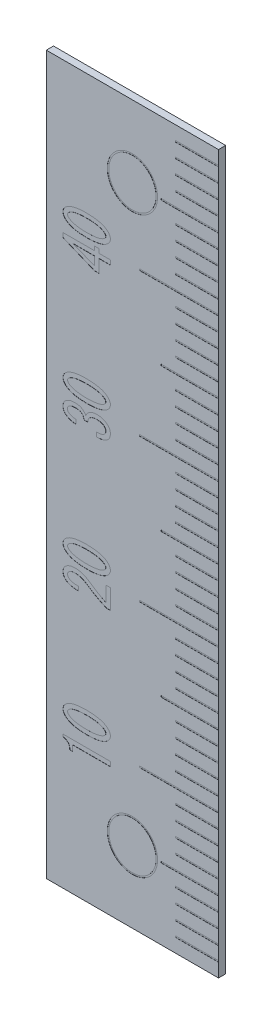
from build123d import *

# Parameters (mm, degrees)
SKETCH1_W      = 12
SKETCH1_H      = 50
EXTRUDE1_DEPTH = 0.5
SKETCH2_R      = 1.75
SKETCH2_R_2    = 1.65
EXTRUDE2_DEPTH = 0.01
EXTRUDE3_DEPTH = 0.01
SKETCH4_W      = 5.5
SKETCH4_H      = 0.1
SKETCH4_W_2    = 3
SKETCH4_W_3    = 4
EXTRUDE4_DEPTH = 0.01


with BuildPart() as part:
    # Sketch1 → Extrude1 (new body)
    with BuildSketch(Plane.XY):
        with Locations((6, 25)):
            Rectangle(SKETCH1_W, SKETCH1_H)
    extrude(amount=EXTRUDE1_DEPTH)

    # Sketch2 → Extrude2 (cut)
    # profile 1 of 2: a face of its own
    with BuildSketch(Plane.XY.offset(0.5)):
        with Locations((6, 5)):
            Circle(SKETCH2_R)
        with Locations((6, 5)):
            Circle(SKETCH2_R_2, mode=Mode.SUBTRACT)
    # profile 2 of 2: a face of its own
    with BuildSketch(Plane.XY.offset(0.5)):
        with Locations((6, 45)):
            Circle(SKETCH2_R)
        with Locations((6, 45)):
            Circle(SKETCH2_R_2, mode=Mode.SUBTRACT)
    extrude(amount=-EXTRUDE2_DEPTH, mode=Mode.SUBTRACT)

    # Sketch3 → Extrude3 (cut)
    # profile 1 of 8: a face of its own
    with BuildSketch(Plane.XY.offset(0.5)):
        Polygon((4.464202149, 39.253595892), (4.076078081, 39.253595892), (3.68481385, 39.253595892), (3.68481385, 38.358021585), (3.363889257, 38.358021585), (1.159495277, 39.263016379), (1.159495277, 39.57326442), (3.363889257, 39.57326442), (3.363889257, 39.857135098), (3.68481385, 39.857135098), (3.68481385, 39.57326442), (4.464202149, 39.57326442), align=None)
        Polygon((3.363889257, 39.253595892), (1.871684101, 39.253595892), (3.363889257, 38.655080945), align=None, mode=Mode.SUBTRACT)
    # profile 2 of 8: a face of its own
    with BuildSketch(Plane.XY.offset(0.5)):
        with BuildLine():
            add(Edge.make_bspline(
                [(2.804312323, 40.08636695), (2.763487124, 40.086598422), (2.683284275, 40.087053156), (2.565184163, 40.090916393), (2.451677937, 40.097059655), (2.342790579, 40.105920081), (2.238418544, 40.116877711), (2.138826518, 40.131643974), (2.043659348, 40.147711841), (1.953367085, 40.166540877), (1.867534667, 40.187646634), (1.786660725, 40.212475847), (1.709981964, 40.238496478), (1.63792646, 40.267351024), (1.571052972, 40.299483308), (1.508231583, 40.333293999), (1.450513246, 40.370357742), (1.414537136, 40.397244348), (1.396891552, 40.410431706)],
                knots=[0, 0, 0, 0, 1.334199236, 2.621091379, 3.861325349, 5.048806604, 6.191184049, 7.29033474, 8.338632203, 9.344988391, 10.304094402, 11.226124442, 12.10888774, 12.949942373, 13.760906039, 14.53244093, 15.280190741, 16, 16, 16, 16], degree=3))
            add(Edge.make_bspline(
                [(1.396891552, 40.410431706), (1.377886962, 40.425936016), (1.341081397, 40.455962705), (1.293642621, 40.506288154), (1.25209867, 40.556343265), (1.218531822, 40.608467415), (1.191781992, 40.661574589), (1.173561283, 40.716630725), (1.161657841, 40.77250316), (1.160214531, 40.810429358), (1.159495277, 40.829329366)],
                knots=[0, 0, 0, 0, 1.179273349, 2.283859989, 3.322502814, 4.306324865, 5.261663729, 6.17616916, 7.091118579, 8, 8, 8, 8], degree=3))
            add(Edge.make_bspline(
                [(1.159495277, 40.829329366), (1.160212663, 40.848230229), (1.161652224, 40.886158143), (1.17358392, 40.942017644), (1.191636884, 40.996945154), (1.218688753, 41.049705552), (1.252296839, 41.101723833), (1.293217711, 41.152330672), (1.341340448, 41.202029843), (1.377935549, 41.232049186), (1.396891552, 41.247598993)],
                knots=[0, 0, 0, 0, 0.909839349, 1.825753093, 2.741222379, 3.688535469, 4.673394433, 5.720979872, 6.819483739, 8, 8, 8, 8], degree=3))
            add(Edge.make_bspline(
                [(1.396891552, 41.247598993), (1.414537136, 41.260786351), (1.450513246, 41.287672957), (1.508231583, 41.3247367), (1.571052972, 41.358547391), (1.63792646, 41.390679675), (1.709981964, 41.419534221), (1.786660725, 41.445554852), (1.867534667, 41.470384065), (1.953367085, 41.491489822), (2.043659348, 41.510318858), (2.138826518, 41.526386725), (2.238418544, 41.541152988), (2.342790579, 41.552110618), (2.451677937, 41.560971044), (2.565184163, 41.567114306), (2.683284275, 41.570977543), (2.763487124, 41.571432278), (2.804312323, 41.571663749)],
                knots=[0, 0, 0, 0, 0.719809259, 1.46755907, 2.239093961, 3.050057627, 3.89111226, 4.773875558, 5.695905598, 6.655011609, 7.661367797, 8.70966526, 9.808815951, 10.951193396, 12.138674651, 13.378908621, 14.665800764, 16, 16, 16, 16], degree=3))
            add(Edge.make_bspline(
                [(2.804312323, 41.571663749), (2.845974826, 41.571432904), (2.927642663, 41.570980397), (3.047627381, 41.567132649), (3.162805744, 41.560946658), (3.273365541, 41.552091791), (3.379218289, 41.541255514), (3.480042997, 41.52631378), (3.576267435, 41.510328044), (3.667806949, 41.49146689), (3.75471717, 41.470480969), (3.836402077, 41.445542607), (3.913707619, 41.419531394), (3.986394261, 41.390685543), (4.053875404, 41.358519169), (4.117234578, 41.324907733), (4.175058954, 41.28765614), (4.211041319, 41.260780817), (4.228689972, 41.247598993)],
                knots=[0, 0, 0, 0, 1.346341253, 2.639130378, 3.8790076, 5.073442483, 6.223226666, 7.316783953, 8.366697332, 9.375051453, 10.336565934, 11.254764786, 12.134057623, 12.971986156, 13.779994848, 14.548849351, 15.288238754, 16, 16, 16, 16], degree=3))
            add(Edge.make_bspline(
                [(4.228689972, 41.247598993), (4.247351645, 41.231964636), (4.283604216, 41.201592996), (4.332476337, 41.152791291), (4.372490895, 41.101447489), (4.406527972, 41.049937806), (4.432289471, 40.996615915), (4.451811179, 40.942259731), (4.462410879, 40.886054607), (4.464024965, 40.848209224), (4.464830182, 40.829329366)],
                knots=[0, 0, 0, 0, 1.1743338, 2.28128622, 3.323893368, 4.309986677, 5.254013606, 6.173907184, 7.08902033, 8, 8, 8, 8], degree=3))
            add(Edge.make_bspline(
                [(4.464830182, 40.829329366), (4.464023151, 40.81045032), (4.462405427, 40.772606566), (4.45183315, 40.716389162), (4.432141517, 40.661902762), (4.406685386, 40.608236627), (4.372691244, 40.556620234), (4.332051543, 40.505827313), (4.283860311, 40.456400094), (4.247399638, 40.426020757), (4.228689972, 40.410431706)],
                knots=[0, 0, 0, 0, 0.910025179, 1.824179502, 2.743109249, 3.69522398, 4.680284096, 5.713901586, 6.826896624, 8, 8, 8, 8], degree=3))
            add(Edge.make_bspline(
                [(4.228689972, 40.410431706), (4.211041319, 40.397249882), (4.175058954, 40.370374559), (4.117234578, 40.333122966), (4.053875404, 40.29951153), (3.986394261, 40.267345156), (3.913707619, 40.238499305), (3.836402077, 40.212488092), (3.75471717, 40.18754973), (3.667806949, 40.166563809), (3.576267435, 40.147702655), (3.480042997, 40.131716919), (3.379218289, 40.116775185), (3.273365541, 40.105938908), (3.162805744, 40.097084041), (3.047627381, 40.09089805), (2.927642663, 40.087050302), (2.845974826, 40.086597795), (2.804312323, 40.08636695)],
                knots=[0, 0, 0, 0, 0.711761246, 1.451150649, 2.220005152, 3.028013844, 3.865942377, 4.745235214, 5.663434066, 6.624948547, 7.633302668, 8.683216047, 9.776773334, 10.926557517, 12.1209924, 13.360869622, 14.653658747, 16, 16, 16, 16], degree=3))
        make_face()
        with BuildLine():
            add(Edge.make_bspline(
                [(2.804312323, 41.261415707), (2.767676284, 41.261069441), (2.695861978, 41.260390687), (2.590316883, 41.258165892), (2.489150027, 41.253278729), (2.392481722, 41.245290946), (2.30022693, 41.237179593), (2.212814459, 41.225295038), (2.129718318, 41.213328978), (2.051258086, 41.197943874), (1.97692929, 41.181420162), (1.907398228, 41.16150603), (1.841873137, 41.141413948), (1.781453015, 41.117852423), (1.725379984, 41.092883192), (1.673815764, 41.065786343), (1.626168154, 41.037204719), (1.597468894, 41.015283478), (1.583417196, 41.004550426)],
                knots=[0, 0, 0, 0, 1.387476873, 2.71974516, 3.997715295, 5.222316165, 6.392993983, 7.5041764, 8.562605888, 9.571696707, 10.531368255, 11.445041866, 12.310057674, 13.125709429, 13.899281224, 14.633331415, 15.330853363, 16, 16, 16, 16], degree=3))
            add(Edge.make_bspline(
                [(1.583417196, 41.004550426), (1.567942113, 40.991309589), (1.538992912, 40.966539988), (1.506840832, 40.922559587), (1.485224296, 40.87705391), (1.482844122, 40.845041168), (1.481675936, 40.829329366)],
                knots=[0, 0, 0, 0, 1.162721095, 2.175099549, 3.10434177, 4, 4, 4, 4], degree=3))
            add(Edge.make_bspline(
                [(1.481675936, 40.829329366), (1.482836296, 40.813611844), (1.485200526, 40.781587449), (1.507018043, 40.736019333), (1.538753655, 40.691521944), (1.567903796, 40.666693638), (1.583417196, 40.653480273)],
                knots=[0, 0, 0, 0, 0.893494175, 1.820491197, 2.840088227, 4, 4, 4, 4], degree=3))
            add(Edge.make_bspline(
                [(1.583417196, 40.653480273), (1.598156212, 40.643035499), (1.628454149, 40.621564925), (1.677291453, 40.592299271), (1.730299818, 40.565060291), (1.787887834, 40.540907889), (1.849363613, 40.517529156), (1.915145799, 40.496237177), (1.985227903, 40.477516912), (2.059390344, 40.460570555), (2.137959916, 40.445608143), (2.220652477, 40.432335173), (2.307623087, 40.421817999), (2.398748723, 40.413272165), (2.494176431, 40.405404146), (2.593874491, 40.400498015), (2.697746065, 40.398267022), (2.768304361, 40.397589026), (2.804312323, 40.397243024)],
                knots=[0, 0, 0, 0, 0.684573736, 1.407229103, 2.156074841, 2.941731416, 3.772993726, 4.648817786, 5.561264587, 6.521855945, 7.531913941, 8.592575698, 9.69595549, 10.851956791, 12.06190895, 13.325252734, 14.634998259, 16, 16, 16, 16], degree=3))
            add(Edge.make_bspline(
                [(2.804312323, 40.397243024), (2.841785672, 40.397588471), (2.915065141, 40.398263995), (3.022703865, 40.400490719), (3.125541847, 40.405385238), (3.223691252, 40.413273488), (3.317323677, 40.421841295), (3.406404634, 40.432229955), (3.490753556, 40.445635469), (3.570391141, 40.460491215), (3.645369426, 40.477539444), (3.715901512, 40.496147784), (3.781702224, 40.517419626), (3.842729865, 40.540898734), (3.899661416, 40.565104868), (3.951853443, 40.591966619), (3.99904188, 40.621590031), (4.028053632, 40.643045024), (4.042164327, 40.653480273)],
                knots=[0, 0, 0, 0, 1.401046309, 2.739758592, 4.0248449, 5.249399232, 6.420696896, 7.540008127, 8.601571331, 9.613140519, 10.568176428, 11.475655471, 12.339456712, 13.151990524, 13.919674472, 14.651282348, 15.344012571, 16, 16, 16, 16], degree=3))
            add(Edge.make_bspline(
                [(4.042164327, 40.653480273), (4.057596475, 40.666746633), (4.086687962, 40.691755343), (4.119429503, 40.735654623), (4.140196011, 40.781762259), (4.142682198, 40.813642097), (4.143905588, 40.829329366)],
                knots=[0, 0, 0, 0, 1.159232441, 2.18529495, 3.107029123, 4, 4, 4, 4], degree=3))
            add(Edge.make_bspline(
                [(4.143905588, 40.829329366), (4.142674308, 40.845010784), (4.140172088, 40.876878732), (4.119603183, 40.922925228), (4.086449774, 40.966304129), (4.057558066, 40.991255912), (4.042164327, 41.004550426)],
                knots=[0, 0, 0, 0, 0.89511734, 1.819067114, 2.837981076, 4, 4, 4, 4], degree=3))
            add(Edge.make_bspline(
                [(4.042164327, 41.004550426), (4.028109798, 41.015278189), (3.999404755, 41.037188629), (3.95164342, 41.065951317), (3.899548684, 41.092855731), (3.842868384, 41.117856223), (3.781814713, 41.14140776), (3.715668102, 41.161504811), (3.64550559, 41.181409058), (3.570358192, 41.198018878), (3.490830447, 41.213306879), (3.406283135, 41.225349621), (3.317389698, 41.237124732), (3.22367965, 41.245296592), (3.125545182, 41.253298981), (3.022702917, 41.258160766), (2.915065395, 41.26039668), (2.841785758, 41.261070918), (2.804312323, 41.261415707)],
                knots=[0, 0, 0, 0, 0.660466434, 1.348940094, 2.080407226, 2.851088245, 3.663465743, 4.524722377, 5.434082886, 6.388935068, 7.400309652, 8.46048529, 9.580538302, 10.751610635, 11.975929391, 13.260768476, 14.599223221, 16, 16, 16, 16], degree=3))
        make_face(mode=Mode.SUBTRACT)
    # profile 3 of 8: a face of its own
    with BuildSketch(Plane.XY.offset(0.5)):
        with BuildLine():
            add(Edge.make_bspline(
                [(3.482587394, 28.709091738), (3.512525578, 28.708287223), (3.570543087, 28.706728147), (3.654420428, 28.710760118), (3.732130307, 28.718455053), (3.803298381, 28.73168567), (3.868273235, 28.749141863), (3.927053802, 28.770782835), (3.979378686, 28.79791141), (4.010164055, 28.820091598), (4.025207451, 28.830930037)],
                knots=[0, 0, 0, 0, 1.267087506, 2.455501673, 3.55133733, 4.569646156, 5.515332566, 6.395721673, 7.21606285, 8, 8, 8, 8], degree=3))
            add(Edge.make_bspline(
                [(4.025207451, 28.830930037), (4.043506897, 28.847280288), (4.079345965, 28.8793019), (4.117183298, 28.941459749), (4.139871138, 29.011713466), (4.142530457, 29.061449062), (4.143905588, 29.087167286)],
                knots=[0, 0, 0, 0, 1.002413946, 1.963205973, 2.946775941, 4, 4, 4, 4], degree=3))
            add(Edge.make_bspline(
                [(4.143905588, 29.087167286), (4.14205895, 29.10966892), (4.138250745, 29.15607263), (4.10631016, 29.222801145), (4.057507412, 29.287350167), (4.014319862, 29.324320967), (3.991293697, 29.344032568)],
                knots=[0, 0, 0, 0, 0.87119639, 1.796613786, 2.82522778, 4, 4, 4, 4], degree=3))
            add(Edge.make_bspline(
                [(3.991293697, 29.344032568), (3.977715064, 29.35383947), (3.949615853, 29.374133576), (3.90102721, 29.398039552), (3.847048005, 29.41973801), (3.786272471, 29.436247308), (3.719328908, 29.449449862), (3.646079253, 29.458528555), (3.566417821, 29.464292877), (3.511278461, 29.464917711), (3.482587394, 29.465242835)],
                knots=[0, 0, 0, 0, 0.754595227, 1.561536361, 2.43511806, 3.377163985, 4.397951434, 5.512234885, 6.705522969, 8, 8, 8, 8], degree=3))
            add(Edge.make_bspline(
                [(3.482587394, 29.465242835), (3.460377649, 29.46473344), (3.416687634, 29.463731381), (3.35267071, 29.456647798), (3.291236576, 29.44559945), (3.232735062, 29.428991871), (3.176430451, 29.40846888), (3.123062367, 29.382368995), (3.071883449, 29.352579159), (3.040443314, 29.328863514), (3.024751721, 29.317027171)],
                knots=[0, 0, 0, 0, 1.086352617, 2.137024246, 3.147391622, 4.136355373, 5.10847195, 6.074961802, 7.039224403, 8, 8, 8, 8], degree=3))
            add(Edge.make_bspline(
                [(3.024751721, 29.317027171), (3.014022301, 29.307663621), (2.992758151, 29.289106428), (2.965670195, 29.256771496), (2.94319759, 29.221167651), (2.926529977, 29.181802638), (2.913593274, 29.139332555), (2.906578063, 29.093273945), (2.903067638, 29.044064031), (2.905038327, 29.010337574), (2.906053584, 28.992962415)],
                knots=[0, 0, 0, 0, 0.947861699, 1.87852391, 2.799832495, 3.743268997, 4.71875736, 5.750864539, 6.841292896, 8, 8, 8, 8], degree=3))
            Line((2.906053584, 28.992962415), (2.617786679, 28.992962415))
            add(Edge.make_bspline(
                [(2.617786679, 28.992962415), (2.615917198, 29.01036469), (2.61227151, 29.044300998), (2.603170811, 29.09366086), (2.589082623, 29.139312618), (2.572365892, 29.182135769), (2.550836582, 29.220887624), (2.526138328, 29.256550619), (2.497813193, 29.288974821), (2.476089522, 29.307646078), (2.465174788, 29.317027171)],
                knots=[0, 0, 0, 0, 1.139052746, 2.221275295, 3.260086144, 4.244297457, 5.207730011, 6.137529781, 7.064229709, 8, 8, 8, 8], degree=3))
            add(Edge.make_bspline(
                [(2.465174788, 29.317027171), (2.453430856, 29.325692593), (2.429384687, 29.343435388), (2.388683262, 29.365118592), (2.344024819, 29.38418922), (2.294826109, 29.398815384), (2.241812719, 29.411043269), (2.184417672, 29.41879032), (2.12278159, 29.423939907), (2.080202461, 29.42467109), (2.058209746, 29.425048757)],
                knots=[0, 0, 0, 0, 0.816014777, 1.670822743, 2.574059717, 3.530392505, 4.539613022, 5.616822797, 6.769055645, 8, 8, 8, 8], degree=3))
            add(Edge.make_bspline(
                [(2.058209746, 29.425048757), (2.030985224, 29.424710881), (1.978357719, 29.424057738), (1.902231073, 29.418395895), (1.831762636, 29.409047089), (1.766898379, 29.396390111), (1.708285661, 29.3784051), (1.654956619, 29.358063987), (1.60766056, 29.33316966), (1.579858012, 29.312952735), (1.56646032, 29.303210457)],
                knots=[0, 0, 0, 0, 1.267211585, 2.44963652, 3.550842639, 4.575246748, 5.5217347, 6.401234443, 7.229575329, 8, 8, 8, 8], degree=3))
            add(Edge.make_bspline(
                [(1.56646032, 29.303210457), (1.550800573, 29.289680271), (1.520516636, 29.263514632), (1.489112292, 29.21338768), (1.467772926, 29.159180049), (1.465751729, 29.120663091), (1.464719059, 29.100984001)],
                knots=[0, 0, 0, 0, 1.053722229, 2.037763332, 2.997453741, 4, 4, 4, 4], degree=3))
            add(Edge.make_bspline(
                [(1.464719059, 29.100984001), (1.465793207, 29.081323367), (1.467906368, 29.0426452), (1.488749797, 28.988170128), (1.520925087, 28.938367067), (1.550860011, 28.911914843), (1.56646032, 28.898129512)],
                knots=[0, 0, 0, 0, 1.000412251, 1.968100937, 2.94109465, 4, 4, 4, 4], degree=3))
            add(Edge.make_bspline(
                [(1.56646032, 28.898129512), (1.581277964, 28.887055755), (1.611428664, 28.864523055), (1.662612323, 28.837488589), (1.718046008, 28.812216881), (1.779698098, 28.793150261), (1.845928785, 28.775455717), (1.917710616, 28.763754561), (1.994531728, 28.75366975), (2.047707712, 28.75119286), (2.075166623, 28.749913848)],
                knots=[0, 0, 0, 0, 0.823448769, 1.675540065, 2.573857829, 3.535986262, 4.547798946, 5.627975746, 6.775138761, 8, 8, 8, 8], degree=3))
            Line((2.075166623, 28.749913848), (2.075166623, 28.452854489))
            add(Edge.make_bspline(
                [(2.075166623, 28.452854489), (2.039320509, 28.454383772), (1.969081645, 28.457380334), (1.86662153, 28.471341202), (1.769148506, 28.489228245), (1.677509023, 28.515831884), (1.590488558, 28.54647123), (1.509243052, 28.585395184), (1.432662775, 28.629471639), (1.386090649, 28.664635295), (1.362977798, 28.682086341)],
                knots=[0, 0, 0, 0, 1.130465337, 2.215096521, 3.257023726, 4.251490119, 5.220175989, 6.161913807, 7.087793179, 8, 8, 8, 8], degree=3))
            add(Edge.make_bspline(
                [(1.362977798, 28.682086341), (1.3467956, 28.695809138), (1.31513049, 28.722661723), (1.272968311, 28.767477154), (1.238724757, 28.816404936), (1.209237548, 28.867139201), (1.18725208, 28.92158891), (1.170766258, 28.978543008), (1.161240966, 29.038909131), (1.160084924, 29.080016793), (1.159495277, 29.100984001)],
                knots=[0, 0, 0, 0, 1.054146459, 2.062739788, 3.04727221, 4.0164563, 4.972878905, 5.957576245, 6.958249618, 8, 8, 8, 8], degree=3))
            add(Edge.make_bspline(
                [(1.159495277, 29.100984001), (1.160084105, 29.122995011), (1.161233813, 29.165972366), (1.17065538, 29.228867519), (1.187412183, 29.288028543), (1.208926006, 29.344536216), (1.238532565, 29.396768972), (1.273183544, 29.446397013), (1.314699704, 29.492477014), (1.346729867, 29.519408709), (1.362977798, 29.533070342)],
                knots=[0, 0, 0, 0, 1.066551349, 2.082482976, 3.072030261, 4.042353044, 5.005167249, 5.973525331, 6.972030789, 8, 8, 8, 8], degree=3))
            add(Edge.make_bspline(
                [(1.362977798, 29.533070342), (1.383180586, 29.548391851), (1.423800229, 29.579197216), (1.49101211, 29.617407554), (1.563031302, 29.649133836), (1.639054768, 29.676462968), (1.720201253, 29.697274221), (1.806188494, 29.711237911), (1.896823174, 29.720285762), (1.958748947, 29.721491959), (1.990382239, 29.722108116)],
                knots=[0, 0, 0, 0, 0.910342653, 1.830331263, 2.769796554, 3.735781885, 4.730142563, 5.775142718, 6.863485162, 8, 8, 8, 8], degree=3))
            add(Edge.make_bspline(
                [(1.990382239, 29.722108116), (2.019286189, 29.72161156), (2.075295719, 29.720649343), (2.156472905, 29.713669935), (2.232474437, 29.70249683), (2.303229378, 29.686672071), (2.368446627, 29.664650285), (2.428974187, 29.640082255), (2.484286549, 29.610093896), (2.516949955, 29.585400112), (2.533002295, 29.57326442)],
                knots=[0, 0, 0, 0, 1.210143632, 2.344993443, 3.40861805, 4.424997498, 5.37575867, 6.287368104, 7.158331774, 8, 8, 8, 8], degree=3))
            add(Edge.make_bspline(
                [(2.533002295, 29.57326442), (2.559175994, 29.551536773), (2.608490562, 29.51059913), (2.671793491, 29.445781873), (2.721317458, 29.38266922), (2.743208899, 29.337936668), (2.753441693, 29.317027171)],
                knots=[0, 0, 0, 0, 1.195517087, 2.252505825, 3.183162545, 4, 4, 4, 4], degree=3))
            add(Edge.make_bspline(
                [(2.753441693, 29.317027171), (2.765088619, 29.34500906), (2.787538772, 29.398945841), (2.831763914, 29.47199791), (2.881380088, 29.535717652), (2.920772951, 29.570253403), (2.939967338, 29.587081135)],
                knots=[0, 0, 0, 0, 1.094399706, 2.109521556, 3.078854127, 4, 4, 4, 4], degree=3))
            add(Edge.make_bspline(
                [(2.939967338, 29.587081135), (2.959994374, 29.60234586), (2.999821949, 29.632702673), (3.064355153, 29.670989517), (3.132227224, 29.703077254), (3.202874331, 29.730156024), (3.276856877, 29.751027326), (3.354027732, 29.765256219), (3.434226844, 29.774233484), (3.488843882, 29.775485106), (3.516501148, 29.776118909)],
                knots=[0, 0, 0, 0, 0.976244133, 1.941447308, 2.904084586, 3.885987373, 4.873249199, 5.881498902, 6.927222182, 8, 8, 8, 8], degree=3))
            add(Edge.make_bspline(
                [(3.516501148, 29.776118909), (3.552324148, 29.77559206), (3.622443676, 29.774560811), (3.725084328, 29.764261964), (3.822576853, 29.747624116), (3.914506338, 29.72361205), (4.001245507, 29.69357359), (4.082537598, 29.656250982), (4.159144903, 29.612707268), (4.205595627, 29.577553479), (4.228689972, 29.560075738)],
                knots=[0, 0, 0, 0, 1.13285732, 2.217441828, 3.259318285, 4.258350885, 5.219645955, 6.158999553, 7.084692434, 8, 8, 8, 8], degree=3))
            add(Edge.make_bspline(
                [(4.228689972, 29.560075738), (4.247408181, 29.544073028), (4.284031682, 29.512762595), (4.332853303, 29.461250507), (4.373280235, 29.40591535), (4.406871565, 29.348128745), (4.432721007, 29.287091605), (4.451971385, 29.223397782), (4.462541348, 29.156184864), (4.464058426, 29.110438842), (4.464830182, 29.087167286)],
                knots=[0, 0, 0, 0, 1.078182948, 2.109541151, 3.099814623, 4.073306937, 5.030426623, 5.996463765, 6.980776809, 8, 8, 8, 8], degree=3))
            add(Edge.make_bspline(
                [(4.464830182, 29.087167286), (4.464367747, 29.062001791), (4.463461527, 29.012685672), (4.452274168, 28.941195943), (4.435512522, 28.873719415), (4.411441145, 28.810497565), (4.38066456, 28.751121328), (4.342591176, 28.696168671), (4.297876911, 28.645289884), (4.263207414, 28.615937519), (4.245646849, 28.601070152)],
                knots=[0, 0, 0, 0, 1.091653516, 2.139282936, 3.133504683, 4.105839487, 5.069340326, 6.029921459, 7.002128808, 8, 8, 8, 8], degree=3))
            add(Edge.make_bspline(
                [(4.245646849, 28.601070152), (4.223356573, 28.584883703), (4.177849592, 28.551838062), (4.101818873, 28.510403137), (4.01783525, 28.476087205), (3.926096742, 28.448030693), (3.826687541, 28.425207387), (3.71890008, 28.410072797), (3.603344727, 28.400491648), (3.523639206, 28.399403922), (3.482587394, 28.398843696)],
                knots=[0, 0, 0, 0, 0.821972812, 1.678108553, 2.577822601, 3.526913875, 4.539938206, 5.620279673, 6.774340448, 8, 8, 8, 8], degree=3))
            Line((3.482587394, 28.398843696), (3.482587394, 28.709091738))
        make_face()
    # profile 4 of 8: a face of its own
    with BuildSketch(Plane.XY.offset(0.5)):
        with BuildLine():
            add(Edge.make_bspline(
                [(2.804312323, 30.08636695), (2.763487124, 30.086598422), (2.683284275, 30.087053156), (2.565184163, 30.090916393), (2.451677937, 30.097059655), (2.342790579, 30.105920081), (2.238418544, 30.116877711), (2.138826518, 30.131643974), (2.043659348, 30.147711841), (1.953367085, 30.166540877), (1.867534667, 30.187646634), (1.786660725, 30.212475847), (1.709981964, 30.238496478), (1.63792646, 30.267351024), (1.571052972, 30.299483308), (1.508231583, 30.333293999), (1.450513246, 30.370357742), (1.414537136, 30.397244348), (1.396891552, 30.410431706)],
                knots=[0, 0, 0, 0, 1.334199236, 2.621091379, 3.861325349, 5.048806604, 6.191184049, 7.29033474, 8.338632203, 9.344988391, 10.304094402, 11.226124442, 12.10888774, 12.949942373, 13.760906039, 14.53244093, 15.280190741, 16, 16, 16, 16], degree=3))
            add(Edge.make_bspline(
                [(1.396891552, 30.410431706), (1.377886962, 30.425936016), (1.341081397, 30.455962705), (1.293642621, 30.506288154), (1.25209867, 30.556343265), (1.218531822, 30.608467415), (1.191781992, 30.661574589), (1.173561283, 30.716630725), (1.161657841, 30.77250316), (1.160214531, 30.810429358), (1.159495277, 30.829329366)],
                knots=[0, 0, 0, 0, 1.179273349, 2.283859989, 3.322502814, 4.306324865, 5.261663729, 6.17616916, 7.091118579, 8, 8, 8, 8], degree=3))
            add(Edge.make_bspline(
                [(1.159495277, 30.829329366), (1.160212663, 30.848230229), (1.161652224, 30.886158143), (1.17358392, 30.942017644), (1.191636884, 30.996945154), (1.218688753, 31.049705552), (1.252296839, 31.101723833), (1.293217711, 31.152330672), (1.341340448, 31.202029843), (1.377935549, 31.232049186), (1.396891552, 31.247598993)],
                knots=[0, 0, 0, 0, 0.909839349, 1.825753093, 2.741222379, 3.688535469, 4.673394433, 5.720979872, 6.819483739, 8, 8, 8, 8], degree=3))
            add(Edge.make_bspline(
                [(1.396891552, 31.247598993), (1.414537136, 31.260786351), (1.450513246, 31.287672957), (1.508231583, 31.3247367), (1.571052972, 31.358547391), (1.63792646, 31.390679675), (1.709981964, 31.419534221), (1.786660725, 31.445554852), (1.867534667, 31.470384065), (1.953367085, 31.491489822), (2.043659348, 31.510318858), (2.138826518, 31.526386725), (2.238418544, 31.541152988), (2.342790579, 31.552110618), (2.451677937, 31.560971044), (2.565184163, 31.567114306), (2.683284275, 31.570977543), (2.763487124, 31.571432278), (2.804312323, 31.571663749)],
                knots=[0, 0, 0, 0, 0.719809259, 1.46755907, 2.239093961, 3.050057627, 3.89111226, 4.773875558, 5.695905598, 6.655011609, 7.661367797, 8.70966526, 9.808815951, 10.951193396, 12.138674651, 13.378908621, 14.665800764, 16, 16, 16, 16], degree=3))
            add(Edge.make_bspline(
                [(2.804312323, 31.571663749), (2.845974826, 31.571432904), (2.927642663, 31.570980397), (3.047627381, 31.567132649), (3.162805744, 31.560946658), (3.273365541, 31.552091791), (3.379218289, 31.541255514), (3.480042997, 31.52631378), (3.576267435, 31.510328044), (3.667806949, 31.49146689), (3.75471717, 31.470480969), (3.836402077, 31.445542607), (3.913707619, 31.419531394), (3.986394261, 31.390685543), (4.053875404, 31.358519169), (4.117234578, 31.324907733), (4.175058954, 31.28765614), (4.211041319, 31.260780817), (4.228689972, 31.247598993)],
                knots=[0, 0, 0, 0, 1.346341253, 2.639130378, 3.8790076, 5.073442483, 6.223226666, 7.316783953, 8.366697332, 9.375051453, 10.336565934, 11.254764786, 12.134057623, 12.971986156, 13.779994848, 14.548849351, 15.288238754, 16, 16, 16, 16], degree=3))
            add(Edge.make_bspline(
                [(4.228689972, 31.247598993), (4.247351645, 31.231964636), (4.283604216, 31.201592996), (4.332476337, 31.152791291), (4.372490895, 31.101447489), (4.406527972, 31.049937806), (4.432289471, 30.996615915), (4.451811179, 30.942259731), (4.462410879, 30.886054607), (4.464024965, 30.848209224), (4.464830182, 30.829329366)],
                knots=[0, 0, 0, 0, 1.1743338, 2.28128622, 3.323893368, 4.309986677, 5.254013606, 6.173907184, 7.08902033, 8, 8, 8, 8], degree=3))
            add(Edge.make_bspline(
                [(4.464830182, 30.829329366), (4.464023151, 30.81045032), (4.462405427, 30.772606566), (4.45183315, 30.716389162), (4.432141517, 30.661902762), (4.406685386, 30.608236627), (4.372691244, 30.556620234), (4.332051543, 30.505827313), (4.283860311, 30.456400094), (4.247399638, 30.426020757), (4.228689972, 30.410431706)],
                knots=[0, 0, 0, 0, 0.910025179, 1.824179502, 2.743109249, 3.69522398, 4.680284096, 5.713901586, 6.826896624, 8, 8, 8, 8], degree=3))
            add(Edge.make_bspline(
                [(4.228689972, 30.410431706), (4.211041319, 30.397249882), (4.175058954, 30.370374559), (4.117234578, 30.333122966), (4.053875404, 30.29951153), (3.986394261, 30.267345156), (3.913707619, 30.238499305), (3.836402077, 30.212488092), (3.75471717, 30.18754973), (3.667806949, 30.166563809), (3.576267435, 30.147702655), (3.480042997, 30.131716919), (3.379218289, 30.116775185), (3.273365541, 30.105938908), (3.162805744, 30.097084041), (3.047627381, 30.09089805), (2.927642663, 30.087050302), (2.845974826, 30.086597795), (2.804312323, 30.08636695)],
                knots=[0, 0, 0, 0, 0.711761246, 1.451150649, 2.220005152, 3.028013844, 3.865942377, 4.745235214, 5.663434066, 6.624948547, 7.633302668, 8.683216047, 9.776773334, 10.926557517, 12.1209924, 13.360869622, 14.653658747, 16, 16, 16, 16], degree=3))
        make_face()
        with BuildLine():
            add(Edge.make_bspline(
                [(2.804312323, 31.261415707), (2.767676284, 31.261069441), (2.695861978, 31.260390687), (2.590316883, 31.258165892), (2.489150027, 31.253278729), (2.392481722, 31.245290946), (2.30022693, 31.237179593), (2.212814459, 31.225295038), (2.129718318, 31.213328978), (2.051258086, 31.197943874), (1.97692929, 31.181420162), (1.907398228, 31.16150603), (1.841873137, 31.141413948), (1.781453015, 31.117852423), (1.725379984, 31.092883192), (1.673815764, 31.065786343), (1.626168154, 31.037204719), (1.597468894, 31.015283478), (1.583417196, 31.004550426)],
                knots=[0, 0, 0, 0, 1.387476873, 2.71974516, 3.997715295, 5.222316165, 6.392993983, 7.5041764, 8.562605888, 9.571696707, 10.531368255, 11.445041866, 12.310057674, 13.125709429, 13.899281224, 14.633331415, 15.330853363, 16, 16, 16, 16], degree=3))
            add(Edge.make_bspline(
                [(1.583417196, 31.004550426), (1.567942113, 30.991309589), (1.538992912, 30.966539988), (1.506840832, 30.922559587), (1.485224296, 30.87705391), (1.482844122, 30.845041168), (1.481675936, 30.829329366)],
                knots=[0, 0, 0, 0, 1.162721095, 2.175099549, 3.10434177, 4, 4, 4, 4], degree=3))
            add(Edge.make_bspline(
                [(1.481675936, 30.829329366), (1.482836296, 30.813611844), (1.485200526, 30.781587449), (1.507018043, 30.736019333), (1.538753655, 30.691521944), (1.567903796, 30.666693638), (1.583417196, 30.653480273)],
                knots=[0, 0, 0, 0, 0.893494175, 1.820491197, 2.840088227, 4, 4, 4, 4], degree=3))
            add(Edge.make_bspline(
                [(1.583417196, 30.653480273), (1.598156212, 30.643035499), (1.628454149, 30.621564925), (1.677291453, 30.592299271), (1.730299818, 30.565060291), (1.787887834, 30.540907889), (1.849363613, 30.517529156), (1.915145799, 30.496237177), (1.985227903, 30.477516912), (2.059390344, 30.460570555), (2.137959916, 30.445608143), (2.220652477, 30.432335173), (2.307623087, 30.421817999), (2.398748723, 30.413272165), (2.494176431, 30.405404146), (2.593874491, 30.400498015), (2.697746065, 30.398267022), (2.768304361, 30.397589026), (2.804312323, 30.397243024)],
                knots=[0, 0, 0, 0, 0.684573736, 1.407229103, 2.156074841, 2.941731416, 3.772993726, 4.648817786, 5.561264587, 6.521855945, 7.531913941, 8.592575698, 9.69595549, 10.851956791, 12.06190895, 13.325252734, 14.634998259, 16, 16, 16, 16], degree=3))
            add(Edge.make_bspline(
                [(2.804312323, 30.397243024), (2.841785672, 30.397588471), (2.915065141, 30.398263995), (3.022703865, 30.400490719), (3.125541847, 30.405385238), (3.223691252, 30.413273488), (3.317323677, 30.421841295), (3.406404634, 30.432229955), (3.490753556, 30.445635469), (3.570391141, 30.460491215), (3.645369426, 30.477539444), (3.715901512, 30.496147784), (3.781702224, 30.517419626), (3.842729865, 30.540898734), (3.899661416, 30.565104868), (3.951853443, 30.591966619), (3.99904188, 30.621590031), (4.028053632, 30.643045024), (4.042164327, 30.653480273)],
                knots=[0, 0, 0, 0, 1.401046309, 2.739758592, 4.0248449, 5.249399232, 6.420696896, 7.540008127, 8.601571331, 9.613140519, 10.568176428, 11.475655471, 12.339456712, 13.151990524, 13.919674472, 14.651282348, 15.344012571, 16, 16, 16, 16], degree=3))
            add(Edge.make_bspline(
                [(4.042164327, 30.653480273), (4.057596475, 30.666746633), (4.086687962, 30.691755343), (4.119429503, 30.735654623), (4.140196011, 30.781762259), (4.142682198, 30.813642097), (4.143905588, 30.829329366)],
                knots=[0, 0, 0, 0, 1.159232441, 2.18529495, 3.107029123, 4, 4, 4, 4], degree=3))
            add(Edge.make_bspline(
                [(4.143905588, 30.829329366), (4.142674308, 30.845010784), (4.140172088, 30.876878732), (4.119603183, 30.922925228), (4.086449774, 30.966304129), (4.057558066, 30.991255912), (4.042164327, 31.004550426)],
                knots=[0, 0, 0, 0, 0.89511734, 1.819067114, 2.837981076, 4, 4, 4, 4], degree=3))
            add(Edge.make_bspline(
                [(4.042164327, 31.004550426), (4.028109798, 31.015278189), (3.999404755, 31.037188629), (3.95164342, 31.065951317), (3.899548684, 31.092855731), (3.842868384, 31.117856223), (3.781814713, 31.14140776), (3.715668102, 31.161504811), (3.64550559, 31.181409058), (3.570358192, 31.198018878), (3.490830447, 31.213306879), (3.406283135, 31.225349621), (3.317389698, 31.237124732), (3.22367965, 31.245296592), (3.125545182, 31.253298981), (3.022702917, 31.258160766), (2.915065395, 31.26039668), (2.841785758, 31.261070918), (2.804312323, 31.261415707)],
                knots=[0, 0, 0, 0, 0.660466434, 1.348940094, 2.080407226, 2.851088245, 3.663465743, 4.524722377, 5.434082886, 6.388935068, 7.400309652, 8.46048529, 9.580538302, 10.751610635, 11.975929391, 13.260768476, 14.599223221, 16, 16, 16, 16], degree=3))
        make_face(mode=Mode.SUBTRACT)
    # profile 5 of 8: a face of its own
    with BuildSketch(Plane.XY.offset(0.5)):
        with BuildLine():
            Line((4.143905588, 19.789307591), (4.464830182, 19.789307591))
            Line((4.464830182, 19.789307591), (4.464830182, 18.412032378))
            Line((4.464830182, 18.412032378), (4.194776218, 18.412032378))
            add(Edge.make_bspline(
                [(4.194776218, 18.412032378), (4.134104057, 18.438239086), (4.012820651, 18.490626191), (3.833941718, 18.576059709), (3.65666089, 18.664824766), (3.482086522, 18.759401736), (3.309323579, 18.858008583), (3.138392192, 18.960822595), (2.969988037, 19.068963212), (2.859615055, 19.144268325), (2.804312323, 19.18200019)],
                knots=[0, 0, 0, 0, 0.99614483, 1.991289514, 2.987624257, 3.984438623, 4.983697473, 5.985971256, 6.990864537, 8, 8, 8, 8], degree=3))
            add(Edge.make_bspline(
                [(2.804312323, 19.18200019), (2.773407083, 19.202561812), (2.712458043, 19.24311193), (2.617211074, 19.295150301), (2.521104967, 19.339278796), (2.423672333, 19.375332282), (2.325440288, 19.4035815), (2.22593849, 19.42388529), (2.125513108, 19.436178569), (2.058034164, 19.437551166), (2.024295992, 19.438237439)],
                knots=[0, 0, 0, 0, 1.067918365, 2.106070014, 3.119789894, 4.109153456, 5.093164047, 6.058534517, 7.029304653, 8, 8, 8, 8], degree=3))
            add(Edge.make_bspline(
                [(2.024295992, 19.438237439), (2.001046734, 19.437894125), (1.955732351, 19.437224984), (1.889860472, 19.431518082), (1.828132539, 19.422267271), (1.770797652, 19.409104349), (1.71743613, 19.392320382), (1.668710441, 19.370724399), (1.623431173, 19.346637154), (1.596599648, 19.326782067), (1.583417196, 19.317027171)],
                knots=[0, 0, 0, 0, 1.197973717, 2.334932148, 3.404529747, 4.412096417, 5.3640046, 6.281988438, 7.155932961, 8, 8, 8, 8], degree=3))
            add(Edge.make_bspline(
                [(1.583417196, 19.317027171), (1.567746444, 19.303076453), (1.537248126, 19.275925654), (1.505254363, 19.223199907), (1.484772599, 19.164442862), (1.482726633, 19.122515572), (1.481675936, 19.100984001)],
                knots=[0, 0, 0, 0, 1.01321699, 1.971916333, 2.958486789, 4, 4, 4, 4], degree=3))
            add(Edge.make_bspline(
                [(1.481675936, 19.100984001), (1.483585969, 19.082717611), (1.487575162, 19.044567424), (1.51537348, 18.988943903), (1.559276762, 18.934674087), (1.597036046, 18.902326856), (1.61733095, 18.88494083)],
                knots=[0, 0, 0, 0, 0.831770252, 1.737190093, 2.783782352, 4, 4, 4, 4], degree=3))
            add(Edge.make_bspline(
                [(1.61733095, 18.88494083), (1.63152823, 18.875101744), (1.661915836, 18.854042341), (1.715884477, 18.829594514), (1.77953563, 18.808918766), (1.853234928, 18.792609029), (1.936819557, 18.778578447), (2.030630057, 18.769762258), (2.13433812, 18.764032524), (2.206835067, 18.763421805), (2.24473539, 18.76310253)],
                knots=[0, 0, 0, 0, 0.638255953, 1.36611168, 2.182006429, 3.11234378, 4.156826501, 5.317109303, 6.597424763, 8, 8, 8, 8], degree=3))
            Line((2.24473539, 18.76310253), (2.24473539, 18.466043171))
            add(Edge.make_bspline(
                [(2.24473539, 18.466043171), (2.195515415, 18.46790543), (2.100702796, 18.471492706), (1.963728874, 18.483794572), (1.837426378, 18.503038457), (1.721668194, 18.528812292), (1.616016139, 18.559516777), (1.521404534, 18.598268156), (1.436291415, 18.64179784), (1.386844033, 18.67828985), (1.362977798, 18.695903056)],
                knots=[0, 0, 0, 0, 1.276449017, 2.458828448, 3.562299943, 4.585123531, 5.530965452, 6.409552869, 7.23235602, 8, 8, 8, 8], degree=3))
            add(Edge.make_bspline(
                [(1.362977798, 18.695903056), (1.346729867, 18.709564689), (1.314699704, 18.736496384), (1.273183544, 18.782576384), (1.238532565, 18.832204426), (1.208926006, 18.884437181), (1.187412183, 18.940944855), (1.17065538, 19.000105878), (1.161233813, 19.063001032), (1.160084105, 19.105978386), (1.159495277, 19.127989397)],
                knots=[0, 0, 0, 0, 1.027969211, 2.026474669, 2.994832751, 3.957646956, 4.927969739, 5.917517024, 6.933448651, 8, 8, 8, 8], degree=3))
            add(Edge.make_bspline(
                [(1.159495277, 19.127989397), (1.159956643, 19.148979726), (1.160867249, 19.190408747), (1.172379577, 19.250967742), (1.188861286, 19.309450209), (1.21397118, 19.364787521), (1.24481477, 19.418042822), (1.282906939, 19.468678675), (1.328294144, 19.516390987), (1.362484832, 19.545314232), (1.379934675, 19.560075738)],
                knots=[0, 0, 0, 0, 1.000230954, 1.974175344, 2.932001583, 3.893571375, 4.865053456, 5.864036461, 6.909871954, 8, 8, 8, 8], degree=3))
            add(Edge.make_bspline(
                [(1.379934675, 19.560075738), (1.400321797, 19.575446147), (1.441611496, 19.606575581), (1.510569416, 19.644342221), (1.584899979, 19.676515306), (1.664800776, 19.703727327), (1.75083857, 19.724143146), (1.84261768, 19.738396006), (1.93996472, 19.747294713), (2.006900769, 19.748496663), (2.041252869, 19.749113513)],
                knots=[0, 0, 0, 0, 0.873404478, 1.768891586, 2.683909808, 3.645167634, 4.655436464, 5.707963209, 6.823708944, 8, 8, 8, 8], degree=3))
            add(Edge.make_bspline(
                [(2.041252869, 19.749113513), (2.0825466, 19.747997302), (2.165684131, 19.745750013), (2.2908176, 19.728176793), (2.416613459, 19.69873904), (2.543909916, 19.659401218), (2.671696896, 19.607206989), (2.800597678, 19.544064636), (2.930892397, 19.470149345), (3.015481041, 19.41326659), (3.058665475, 19.384226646)],
                knots=[0, 0, 0, 0, 0.902713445, 1.817451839, 2.756860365, 3.725448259, 4.727634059, 5.771721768, 6.862413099, 8, 8, 8, 8], degree=3))
            add(Edge.make_bspline(
                [(3.058665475, 19.384226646), (3.150692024, 19.32107194), (3.331341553, 19.197098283), (3.605692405, 19.027797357), (3.87414261, 18.87223849), (4.055117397, 18.780905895), (4.143905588, 18.736097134)],
                knots=[0, 0, 0, 0, 1.058433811, 2.077721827, 3.056909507, 4, 4, 4, 4], degree=3))
            Line((4.143905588, 18.736097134), (4.143905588, 19.789307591))
        make_face()
    # profile 6 of 8: a face of its own
    with BuildSketch(Plane.XY.offset(0.5)):
        with BuildLine():
            add(Edge.make_bspline(
                [(2.804312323, 20.08636695), (2.763487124, 20.086598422), (2.683284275, 20.087053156), (2.565184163, 20.090916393), (2.451677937, 20.097059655), (2.342790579, 20.105920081), (2.238418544, 20.116877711), (2.138826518, 20.131643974), (2.043659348, 20.147711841), (1.953367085, 20.166540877), (1.867534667, 20.187646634), (1.786660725, 20.212475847), (1.709981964, 20.238496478), (1.63792646, 20.267351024), (1.571052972, 20.299483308), (1.508231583, 20.333293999), (1.450513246, 20.370357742), (1.414537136, 20.397244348), (1.396891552, 20.410431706)],
                knots=[0, 0, 0, 0, 1.334199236, 2.621091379, 3.861325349, 5.048806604, 6.191184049, 7.29033474, 8.338632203, 9.344988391, 10.304094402, 11.226124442, 12.10888774, 12.949942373, 13.760906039, 14.53244093, 15.280190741, 16, 16, 16, 16], degree=3))
            add(Edge.make_bspline(
                [(1.396891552, 20.410431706), (1.377886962, 20.425936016), (1.341081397, 20.455962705), (1.293642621, 20.506288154), (1.25209867, 20.556343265), (1.218531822, 20.608467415), (1.191781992, 20.661574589), (1.173561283, 20.716630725), (1.161657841, 20.77250316), (1.160214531, 20.810429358), (1.159495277, 20.829329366)],
                knots=[0, 0, 0, 0, 1.179273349, 2.283859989, 3.322502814, 4.306324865, 5.261663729, 6.17616916, 7.091118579, 8, 8, 8, 8], degree=3))
            add(Edge.make_bspline(
                [(1.159495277, 20.829329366), (1.160212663, 20.848230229), (1.161652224, 20.886158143), (1.17358392, 20.942017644), (1.191636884, 20.996945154), (1.218688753, 21.049705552), (1.252296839, 21.101723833), (1.293217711, 21.152330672), (1.341340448, 21.202029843), (1.377935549, 21.232049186), (1.396891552, 21.247598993)],
                knots=[0, 0, 0, 0, 0.909839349, 1.825753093, 2.741222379, 3.688535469, 4.673394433, 5.720979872, 6.819483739, 8, 8, 8, 8], degree=3))
            add(Edge.make_bspline(
                [(1.396891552, 21.247598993), (1.414537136, 21.260786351), (1.450513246, 21.287672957), (1.508231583, 21.3247367), (1.571052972, 21.358547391), (1.63792646, 21.390679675), (1.709981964, 21.419534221), (1.786660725, 21.445554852), (1.867534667, 21.470384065), (1.953367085, 21.491489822), (2.043659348, 21.510318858), (2.138826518, 21.526386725), (2.238418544, 21.541152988), (2.342790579, 21.552110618), (2.451677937, 21.560971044), (2.565184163, 21.567114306), (2.683284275, 21.570977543), (2.763487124, 21.571432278), (2.804312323, 21.571663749)],
                knots=[0, 0, 0, 0, 0.719809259, 1.46755907, 2.239093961, 3.050057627, 3.89111226, 4.773875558, 5.695905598, 6.655011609, 7.661367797, 8.70966526, 9.808815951, 10.951193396, 12.138674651, 13.378908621, 14.665800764, 16, 16, 16, 16], degree=3))
            add(Edge.make_bspline(
                [(2.804312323, 21.571663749), (2.845974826, 21.571432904), (2.927642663, 21.570980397), (3.047627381, 21.567132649), (3.162805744, 21.560946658), (3.273365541, 21.552091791), (3.379218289, 21.541255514), (3.480042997, 21.52631378), (3.576267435, 21.510328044), (3.667806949, 21.49146689), (3.75471717, 21.470480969), (3.836402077, 21.445542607), (3.913707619, 21.419531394), (3.986394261, 21.390685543), (4.053875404, 21.358519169), (4.117234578, 21.324907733), (4.175058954, 21.28765614), (4.211041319, 21.260780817), (4.228689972, 21.247598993)],
                knots=[0, 0, 0, 0, 1.346341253, 2.639130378, 3.8790076, 5.073442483, 6.223226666, 7.316783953, 8.366697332, 9.375051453, 10.336565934, 11.254764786, 12.134057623, 12.971986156, 13.779994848, 14.548849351, 15.288238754, 16, 16, 16, 16], degree=3))
            add(Edge.make_bspline(
                [(4.228689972, 21.247598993), (4.247351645, 21.231964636), (4.283604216, 21.201592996), (4.332476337, 21.152791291), (4.372490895, 21.101447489), (4.406527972, 21.049937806), (4.432289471, 20.996615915), (4.451811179, 20.942259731), (4.462410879, 20.886054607), (4.464024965, 20.848209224), (4.464830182, 20.829329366)],
                knots=[0, 0, 0, 0, 1.1743338, 2.28128622, 3.323893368, 4.309986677, 5.254013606, 6.173907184, 7.08902033, 8, 8, 8, 8], degree=3))
            add(Edge.make_bspline(
                [(4.464830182, 20.829329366), (4.464023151, 20.81045032), (4.462405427, 20.772606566), (4.45183315, 20.716389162), (4.432141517, 20.661902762), (4.406685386, 20.608236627), (4.372691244, 20.556620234), (4.332051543, 20.505827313), (4.283860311, 20.456400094), (4.247399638, 20.426020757), (4.228689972, 20.410431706)],
                knots=[0, 0, 0, 0, 0.910025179, 1.824179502, 2.743109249, 3.69522398, 4.680284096, 5.713901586, 6.826896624, 8, 8, 8, 8], degree=3))
            add(Edge.make_bspline(
                [(4.228689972, 20.410431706), (4.211041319, 20.397249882), (4.175058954, 20.370374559), (4.117234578, 20.333122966), (4.053875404, 20.29951153), (3.986394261, 20.267345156), (3.913707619, 20.238499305), (3.836402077, 20.212488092), (3.75471717, 20.18754973), (3.667806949, 20.166563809), (3.576267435, 20.147702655), (3.480042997, 20.131716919), (3.379218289, 20.116775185), (3.273365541, 20.105938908), (3.162805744, 20.097084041), (3.047627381, 20.09089805), (2.927642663, 20.087050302), (2.845974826, 20.086597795), (2.804312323, 20.08636695)],
                knots=[0, 0, 0, 0, 0.711761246, 1.451150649, 2.220005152, 3.028013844, 3.865942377, 4.745235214, 5.663434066, 6.624948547, 7.633302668, 8.683216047, 9.776773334, 10.926557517, 12.1209924, 13.360869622, 14.653658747, 16, 16, 16, 16], degree=3))
        make_face()
        with BuildLine():
            add(Edge.make_bspline(
                [(2.804312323, 21.261415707), (2.767676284, 21.261069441), (2.695861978, 21.260390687), (2.590316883, 21.258165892), (2.489150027, 21.253278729), (2.392481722, 21.245290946), (2.30022693, 21.237179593), (2.212814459, 21.225295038), (2.129718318, 21.213328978), (2.051258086, 21.197943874), (1.97692929, 21.181420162), (1.907398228, 21.16150603), (1.841873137, 21.141413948), (1.781453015, 21.117852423), (1.725379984, 21.092883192), (1.673815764, 21.065786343), (1.626168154, 21.037204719), (1.597468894, 21.015283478), (1.583417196, 21.004550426)],
                knots=[0, 0, 0, 0, 1.387476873, 2.71974516, 3.997715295, 5.222316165, 6.392993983, 7.5041764, 8.562605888, 9.571696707, 10.531368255, 11.445041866, 12.310057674, 13.125709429, 13.899281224, 14.633331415, 15.330853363, 16, 16, 16, 16], degree=3))
            add(Edge.make_bspline(
                [(1.583417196, 21.004550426), (1.567942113, 20.991309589), (1.538992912, 20.966539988), (1.506840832, 20.922559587), (1.485224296, 20.87705391), (1.482844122, 20.845041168), (1.481675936, 20.829329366)],
                knots=[0, 0, 0, 0, 1.162721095, 2.175099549, 3.10434177, 4, 4, 4, 4], degree=3))
            add(Edge.make_bspline(
                [(1.481675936, 20.829329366), (1.482836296, 20.813611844), (1.485200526, 20.781587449), (1.507018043, 20.736019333), (1.538753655, 20.691521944), (1.567903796, 20.666693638), (1.583417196, 20.653480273)],
                knots=[0, 0, 0, 0, 0.893494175, 1.820491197, 2.840088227, 4, 4, 4, 4], degree=3))
            add(Edge.make_bspline(
                [(1.583417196, 20.653480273), (1.598156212, 20.643035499), (1.628454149, 20.621564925), (1.677291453, 20.592299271), (1.730299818, 20.565060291), (1.787887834, 20.540907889), (1.849363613, 20.517529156), (1.915145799, 20.496237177), (1.985227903, 20.477516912), (2.059390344, 20.460570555), (2.137959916, 20.445608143), (2.220652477, 20.432335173), (2.307623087, 20.421817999), (2.398748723, 20.413272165), (2.494176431, 20.405404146), (2.593874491, 20.400498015), (2.697746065, 20.398267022), (2.768304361, 20.397589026), (2.804312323, 20.397243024)],
                knots=[0, 0, 0, 0, 0.684573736, 1.407229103, 2.156074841, 2.941731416, 3.772993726, 4.648817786, 5.561264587, 6.521855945, 7.531913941, 8.592575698, 9.69595549, 10.851956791, 12.06190895, 13.325252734, 14.634998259, 16, 16, 16, 16], degree=3))
            add(Edge.make_bspline(
                [(2.804312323, 20.397243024), (2.841785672, 20.397588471), (2.915065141, 20.398263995), (3.022703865, 20.400490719), (3.125541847, 20.405385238), (3.223691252, 20.413273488), (3.317323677, 20.421841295), (3.406404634, 20.432229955), (3.490753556, 20.445635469), (3.570391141, 20.460491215), (3.645369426, 20.477539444), (3.715901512, 20.496147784), (3.781702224, 20.517419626), (3.842729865, 20.540898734), (3.899661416, 20.565104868), (3.951853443, 20.591966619), (3.99904188, 20.621590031), (4.028053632, 20.643045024), (4.042164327, 20.653480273)],
                knots=[0, 0, 0, 0, 1.401046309, 2.739758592, 4.0248449, 5.249399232, 6.420696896, 7.540008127, 8.601571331, 9.613140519, 10.568176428, 11.475655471, 12.339456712, 13.151990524, 13.919674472, 14.651282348, 15.344012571, 16, 16, 16, 16], degree=3))
            add(Edge.make_bspline(
                [(4.042164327, 20.653480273), (4.057596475, 20.666746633), (4.086687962, 20.691755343), (4.119429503, 20.735654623), (4.140196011, 20.781762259), (4.142682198, 20.813642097), (4.143905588, 20.829329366)],
                knots=[0, 0, 0, 0, 1.159232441, 2.18529495, 3.107029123, 4, 4, 4, 4], degree=3))
            add(Edge.make_bspline(
                [(4.143905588, 20.829329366), (4.142674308, 20.845010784), (4.140172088, 20.876878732), (4.119603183, 20.922925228), (4.086449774, 20.966304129), (4.057558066, 20.991255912), (4.042164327, 21.004550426)],
                knots=[0, 0, 0, 0, 0.89511734, 1.819067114, 2.837981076, 4, 4, 4, 4], degree=3))
            add(Edge.make_bspline(
                [(4.042164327, 21.004550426), (4.028109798, 21.015278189), (3.999404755, 21.037188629), (3.95164342, 21.065951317), (3.899548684, 21.092855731), (3.842868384, 21.117856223), (3.781814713, 21.14140776), (3.715668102, 21.161504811), (3.64550559, 21.181409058), (3.570358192, 21.198018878), (3.490830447, 21.213306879), (3.406283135, 21.225349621), (3.317389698, 21.237124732), (3.22367965, 21.245296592), (3.125545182, 21.253298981), (3.022702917, 21.258160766), (2.915065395, 21.26039668), (2.841785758, 21.261070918), (2.804312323, 21.261415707)],
                knots=[0, 0, 0, 0, 0.660466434, 1.348940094, 2.080407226, 2.851088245, 3.663465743, 4.524722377, 5.434082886, 6.388935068, 7.400309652, 8.46048529, 9.580538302, 10.751610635, 11.975929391, 13.260768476, 14.599223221, 16, 16, 16, 16], degree=3))
        make_face(mode=Mode.SUBTRACT)
    # profile 7 of 8: a face of its own
    with BuildSketch(Plane.XY.offset(0.5)):
        with BuildLine():
            Line((4.464202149, 8.983541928), (3.143449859, 8.983541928))
            Line((3.143449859, 8.983541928), (1.834630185, 8.983541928))
            Line((1.834630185, 8.983541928), (1.834630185, 8.58788147))
            Line((1.834630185, 8.58788147), (1.634287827, 8.58788147))
            add(Edge.make_bspline(
                [(1.634287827, 8.58788147), (1.633949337, 8.607154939), (1.633292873, 8.644533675), (1.627537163, 8.699138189), (1.617992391, 8.750485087), (1.605914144, 8.79930573), (1.588535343, 8.844454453), (1.568559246, 8.887235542), (1.544100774, 8.926478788), (1.516032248, 8.962796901), (1.484633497, 8.996211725), (1.449221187, 9.026469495), (1.410057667, 9.053561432), (1.367120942, 9.077453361), (1.320438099, 9.09818504), (1.270182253, 9.115604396), (1.216225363, 9.130205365), (1.17880858, 9.137442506), (1.159495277, 9.141178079)],
                knots=[0, 0, 0, 0, 1.144858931, 2.220325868, 3.257124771, 4.246590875, 5.202985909, 6.126465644, 7.048017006, 7.94360395, 8.849836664, 9.767181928, 10.705616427, 11.674465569, 12.68221077, 13.736395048, 14.831602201, 16, 16, 16, 16], degree=3))
            Line((1.159495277, 9.141178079), (1.159495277, 9.303210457))
            Line((1.159495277, 9.303210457), (4.464202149, 9.303210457))
            Line((4.464202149, 9.303210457), (4.464202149, 8.983541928))
        make_face()
    # profile 8 of 8: a face of its own
    with BuildSketch(Plane.XY.offset(0.5)):
        with BuildLine():
            add(Edge.make_bspline(
                [(2.804312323, 10.08636695), (2.763487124, 10.086598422), (2.683284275, 10.087053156), (2.565184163, 10.090916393), (2.451677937, 10.097059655), (2.342790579, 10.105920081), (2.238418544, 10.116877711), (2.138826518, 10.131643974), (2.043659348, 10.147711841), (1.953367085, 10.166540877), (1.867534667, 10.187646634), (1.786660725, 10.212475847), (1.709981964, 10.238496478), (1.63792646, 10.267351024), (1.571052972, 10.299483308), (1.508231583, 10.333293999), (1.450513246, 10.370357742), (1.414537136, 10.397244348), (1.396891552, 10.410431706)],
                knots=[0, 0, 0, 0, 1.334199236, 2.621091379, 3.861325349, 5.048806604, 6.191184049, 7.29033474, 8.338632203, 9.344988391, 10.304094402, 11.226124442, 12.10888774, 12.949942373, 13.760906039, 14.53244093, 15.280190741, 16, 16, 16, 16], degree=3))
            add(Edge.make_bspline(
                [(1.396891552, 10.410431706), (1.377886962, 10.425936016), (1.341081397, 10.455962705), (1.293642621, 10.506288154), (1.25209867, 10.556343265), (1.218531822, 10.608467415), (1.191781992, 10.661574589), (1.173561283, 10.716630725), (1.161657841, 10.77250316), (1.160214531, 10.810429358), (1.159495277, 10.829329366)],
                knots=[0, 0, 0, 0, 1.179273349, 2.283859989, 3.322502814, 4.306324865, 5.261663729, 6.17616916, 7.091118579, 8, 8, 8, 8], degree=3))
            add(Edge.make_bspline(
                [(1.159495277, 10.829329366), (1.160212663, 10.848230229), (1.161652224, 10.886158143), (1.17358392, 10.942017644), (1.191636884, 10.996945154), (1.218688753, 11.049705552), (1.252296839, 11.101723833), (1.293217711, 11.152330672), (1.341340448, 11.202029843), (1.377935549, 11.232049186), (1.396891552, 11.247598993)],
                knots=[0, 0, 0, 0, 0.909839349, 1.825753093, 2.741222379, 3.688535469, 4.673394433, 5.720979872, 6.819483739, 8, 8, 8, 8], degree=3))
            add(Edge.make_bspline(
                [(1.396891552, 11.247598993), (1.414537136, 11.260786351), (1.450513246, 11.287672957), (1.508231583, 11.3247367), (1.571052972, 11.358547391), (1.63792646, 11.390679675), (1.709981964, 11.419534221), (1.786660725, 11.445554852), (1.867534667, 11.470384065), (1.953367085, 11.491489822), (2.043659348, 11.510318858), (2.138826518, 11.526386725), (2.238418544, 11.541152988), (2.342790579, 11.552110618), (2.451677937, 11.560971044), (2.565184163, 11.567114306), (2.683284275, 11.570977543), (2.763487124, 11.571432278), (2.804312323, 11.571663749)],
                knots=[0, 0, 0, 0, 0.719809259, 1.46755907, 2.239093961, 3.050057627, 3.89111226, 4.773875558, 5.695905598, 6.655011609, 7.661367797, 8.70966526, 9.808815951, 10.951193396, 12.138674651, 13.378908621, 14.665800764, 16, 16, 16, 16], degree=3))
            add(Edge.make_bspline(
                [(2.804312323, 11.571663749), (2.845974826, 11.571432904), (2.927642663, 11.570980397), (3.047627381, 11.567132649), (3.162805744, 11.560946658), (3.273365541, 11.552091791), (3.379218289, 11.541255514), (3.480042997, 11.52631378), (3.576267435, 11.510328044), (3.667806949, 11.49146689), (3.75471717, 11.470480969), (3.836402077, 11.445542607), (3.913707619, 11.419531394), (3.986394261, 11.390685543), (4.053875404, 11.358519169), (4.117234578, 11.324907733), (4.175058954, 11.28765614), (4.211041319, 11.260780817), (4.228689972, 11.247598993)],
                knots=[0, 0, 0, 0, 1.346341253, 2.639130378, 3.8790076, 5.073442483, 6.223226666, 7.316783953, 8.366697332, 9.375051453, 10.336565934, 11.254764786, 12.134057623, 12.971986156, 13.779994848, 14.548849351, 15.288238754, 16, 16, 16, 16], degree=3))
            add(Edge.make_bspline(
                [(4.228689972, 11.247598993), (4.247351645, 11.231964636), (4.283604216, 11.201592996), (4.332476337, 11.152791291), (4.372490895, 11.101447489), (4.406527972, 11.049937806), (4.432289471, 10.996615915), (4.451811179, 10.942259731), (4.462410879, 10.886054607), (4.464024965, 10.848209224), (4.464830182, 10.829329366)],
                knots=[0, 0, 0, 0, 1.1743338, 2.28128622, 3.323893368, 4.309986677, 5.254013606, 6.173907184, 7.08902033, 8, 8, 8, 8], degree=3))
            add(Edge.make_bspline(
                [(4.464830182, 10.829329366), (4.464023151, 10.81045032), (4.462405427, 10.772606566), (4.45183315, 10.716389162), (4.432141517, 10.661902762), (4.406685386, 10.608236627), (4.372691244, 10.556620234), (4.332051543, 10.505827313), (4.283860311, 10.456400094), (4.247399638, 10.426020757), (4.228689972, 10.410431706)],
                knots=[0, 0, 0, 0, 0.910025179, 1.824179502, 2.743109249, 3.69522398, 4.680284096, 5.713901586, 6.826896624, 8, 8, 8, 8], degree=3))
            add(Edge.make_bspline(
                [(4.228689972, 10.410431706), (4.211041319, 10.397249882), (4.175058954, 10.370374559), (4.117234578, 10.333122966), (4.053875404, 10.29951153), (3.986394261, 10.267345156), (3.913707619, 10.238499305), (3.836402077, 10.212488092), (3.75471717, 10.18754973), (3.667806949, 10.166563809), (3.576267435, 10.147702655), (3.480042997, 10.131716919), (3.379218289, 10.116775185), (3.273365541, 10.105938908), (3.162805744, 10.097084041), (3.047627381, 10.09089805), (2.927642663, 10.087050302), (2.845974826, 10.086597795), (2.804312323, 10.08636695)],
                knots=[0, 0, 0, 0, 0.711761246, 1.451150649, 2.220005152, 3.028013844, 3.865942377, 4.745235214, 5.663434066, 6.624948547, 7.633302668, 8.683216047, 9.776773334, 10.926557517, 12.1209924, 13.360869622, 14.653658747, 16, 16, 16, 16], degree=3))
        make_face()
        with BuildLine():
            add(Edge.make_bspline(
                [(2.804312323, 11.261415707), (2.767676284, 11.261069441), (2.695861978, 11.260390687), (2.590316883, 11.258165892), (2.489150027, 11.253278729), (2.392481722, 11.245290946), (2.30022693, 11.237179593), (2.212814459, 11.225295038), (2.129718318, 11.213328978), (2.051258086, 11.197943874), (1.97692929, 11.181420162), (1.907398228, 11.16150603), (1.841873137, 11.141413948), (1.781453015, 11.117852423), (1.725379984, 11.092883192), (1.673815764, 11.065786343), (1.626168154, 11.037204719), (1.597468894, 11.015283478), (1.583417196, 11.004550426)],
                knots=[0, 0, 0, 0, 1.387476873, 2.71974516, 3.997715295, 5.222316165, 6.392993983, 7.5041764, 8.562605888, 9.571696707, 10.531368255, 11.445041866, 12.310057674, 13.125709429, 13.899281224, 14.633331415, 15.330853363, 16, 16, 16, 16], degree=3))
            add(Edge.make_bspline(
                [(1.583417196, 11.004550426), (1.567942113, 10.991309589), (1.538992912, 10.966539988), (1.506840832, 10.922559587), (1.485224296, 10.87705391), (1.482844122, 10.845041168), (1.481675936, 10.829329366)],
                knots=[0, 0, 0, 0, 1.162721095, 2.175099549, 3.10434177, 4, 4, 4, 4], degree=3))
            add(Edge.make_bspline(
                [(1.481675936, 10.829329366), (1.482836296, 10.813611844), (1.485200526, 10.781587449), (1.507018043, 10.736019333), (1.538753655, 10.691521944), (1.567903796, 10.666693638), (1.583417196, 10.653480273)],
                knots=[0, 0, 0, 0, 0.893494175, 1.820491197, 2.840088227, 4, 4, 4, 4], degree=3))
            add(Edge.make_bspline(
                [(1.583417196, 10.653480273), (1.598156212, 10.643035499), (1.628454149, 10.621564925), (1.677291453, 10.592299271), (1.730299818, 10.565060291), (1.787887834, 10.540907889), (1.849363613, 10.517529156), (1.915145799, 10.496237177), (1.985227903, 10.477516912), (2.059390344, 10.460570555), (2.137959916, 10.445608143), (2.220652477, 10.432335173), (2.307623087, 10.421817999), (2.398748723, 10.413272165), (2.494176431, 10.405404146), (2.593874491, 10.400498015), (2.697746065, 10.398267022), (2.768304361, 10.397589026), (2.804312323, 10.397243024)],
                knots=[0, 0, 0, 0, 0.684573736, 1.407229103, 2.156074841, 2.941731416, 3.772993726, 4.648817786, 5.561264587, 6.521855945, 7.531913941, 8.592575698, 9.69595549, 10.851956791, 12.06190895, 13.325252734, 14.634998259, 16, 16, 16, 16], degree=3))
            add(Edge.make_bspline(
                [(2.804312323, 10.397243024), (2.841785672, 10.397588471), (2.915065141, 10.398263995), (3.022703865, 10.400490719), (3.125541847, 10.405385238), (3.223691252, 10.413273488), (3.317323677, 10.421841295), (3.406404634, 10.432229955), (3.490753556, 10.445635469), (3.570391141, 10.460491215), (3.645369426, 10.477539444), (3.715901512, 10.496147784), (3.781702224, 10.517419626), (3.842729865, 10.540898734), (3.899661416, 10.565104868), (3.951853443, 10.591966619), (3.99904188, 10.621590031), (4.028053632, 10.643045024), (4.042164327, 10.653480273)],
                knots=[0, 0, 0, 0, 1.401046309, 2.739758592, 4.0248449, 5.249399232, 6.420696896, 7.540008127, 8.601571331, 9.613140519, 10.568176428, 11.475655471, 12.339456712, 13.151990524, 13.919674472, 14.651282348, 15.344012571, 16, 16, 16, 16], degree=3))
            add(Edge.make_bspline(
                [(4.042164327, 10.653480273), (4.057596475, 10.666746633), (4.086687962, 10.691755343), (4.119429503, 10.735654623), (4.140196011, 10.781762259), (4.142682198, 10.813642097), (4.143905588, 10.829329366)],
                knots=[0, 0, 0, 0, 1.159232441, 2.18529495, 3.107029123, 4, 4, 4, 4], degree=3))
            add(Edge.make_bspline(
                [(4.143905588, 10.829329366), (4.142674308, 10.845010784), (4.140172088, 10.876878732), (4.119603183, 10.922925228), (4.086449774, 10.966304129), (4.057558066, 10.991255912), (4.042164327, 11.004550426)],
                knots=[0, 0, 0, 0, 0.89511734, 1.819067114, 2.837981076, 4, 4, 4, 4], degree=3))
            add(Edge.make_bspline(
                [(4.042164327, 11.004550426), (4.028109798, 11.015278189), (3.999404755, 11.037188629), (3.95164342, 11.065951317), (3.899548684, 11.092855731), (3.842868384, 11.117856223), (3.781814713, 11.14140776), (3.715668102, 11.161504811), (3.64550559, 11.181409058), (3.570358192, 11.198018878), (3.490830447, 11.213306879), (3.406283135, 11.225349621), (3.317389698, 11.237124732), (3.22367965, 11.245296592), (3.125545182, 11.253298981), (3.022702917, 11.258160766), (2.915065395, 11.26039668), (2.841785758, 11.261070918), (2.804312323, 11.261415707)],
                knots=[0, 0, 0, 0, 0.660466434, 1.348940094, 2.080407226, 2.851088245, 3.663465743, 4.524722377, 5.434082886, 6.388935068, 7.400309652, 8.46048529, 9.580538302, 10.751610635, 11.975929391, 13.260768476, 14.599223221, 16, 16, 16, 16], degree=3))
        make_face(mode=Mode.SUBTRACT)
    extrude(amount=-EXTRUDE3_DEPTH, mode=Mode.SUBTRACT)

    # Sketch4 → Extrude4 (cut)
    with BuildSketch(Plane.XY.offset(0.5)):
        with Locations((9.25, 40)):
            Rectangle(SKETCH4_W, SKETCH4_H)
        with Locations((10.5, 48)):
            Rectangle(SKETCH4_W_2, SKETCH4_H)
        with Locations((10, 45)):
            Rectangle(SKETCH4_W_3, SKETCH4_H)
        with Locations((10.5, 49)):
            Rectangle(SKETCH4_W_2, SKETCH4_H)
        with Locations((10.5, 47)):
            Rectangle(SKETCH4_W_2, SKETCH4_H)
        with Locations((10.5, 46)):
            Rectangle(SKETCH4_W_2, SKETCH4_H)
        with Locations((9.25, 30)):
            Rectangle(SKETCH4_W, SKETCH4_H)
        with Locations((10.5, 44)):
            Rectangle(SKETCH4_W_2, SKETCH4_H)
        with Locations((10.5, 43)):
            Rectangle(SKETCH4_W_2, SKETCH4_H)
        with Locations((10.5, 42)):
            Rectangle(SKETCH4_W_2, SKETCH4_H)
        with Locations((10.5, 41)):
            Rectangle(SKETCH4_W_2, SKETCH4_H)
        with Locations((10.5, 38)):
            Rectangle(SKETCH4_W_2, SKETCH4_H)
        with Locations((10, 35)):
            Rectangle(SKETCH4_W_3, SKETCH4_H)
        with Locations((10.5, 39)):
            Rectangle(SKETCH4_W_2, SKETCH4_H)
        with Locations((10.5, 37)):
            Rectangle(SKETCH4_W_2, SKETCH4_H)
        with Locations((10.5, 36)):
            Rectangle(SKETCH4_W_2, SKETCH4_H)
        with Locations((10.5, 34)):
            Rectangle(SKETCH4_W_2, SKETCH4_H)
        with Locations((10.5, 33)):
            Rectangle(SKETCH4_W_2, SKETCH4_H)
        with Locations((10.5, 32)):
            Rectangle(SKETCH4_W_2, SKETCH4_H)
        with Locations((10.5, 31)):
            Rectangle(SKETCH4_W_2, SKETCH4_H)
        with Locations((9.25, 20)):
            Rectangle(SKETCH4_W, SKETCH4_H)
        with Locations((10.5, 28)):
            Rectangle(SKETCH4_W_2, SKETCH4_H)
        with Locations((10, 25)):
            Rectangle(SKETCH4_W_3, SKETCH4_H)
        with Locations((10.5, 29)):
            Rectangle(SKETCH4_W_2, SKETCH4_H)
        with Locations((10.5, 27)):
            Rectangle(SKETCH4_W_2, SKETCH4_H)
        with Locations((10.5, 26)):
            Rectangle(SKETCH4_W_2, SKETCH4_H)
        with Locations((10.5, 24)):
            Rectangle(SKETCH4_W_2, SKETCH4_H)
        with Locations((10.5, 23)):
            Rectangle(SKETCH4_W_2, SKETCH4_H)
        with Locations((10.5, 22)):
            Rectangle(SKETCH4_W_2, SKETCH4_H)
        with Locations((10.5, 21)):
            Rectangle(SKETCH4_W_2, SKETCH4_H)
        with Locations((9.25, 10)):
            Rectangle(SKETCH4_W, SKETCH4_H)
        with Locations((10.5, 18)):
            Rectangle(SKETCH4_W_2, SKETCH4_H)
        with Locations((10, 15)):
            Rectangle(SKETCH4_W_3, SKETCH4_H)
        with Locations((10.5, 19)):
            Rectangle(SKETCH4_W_2, SKETCH4_H)
        with Locations((10.5, 17)):
            Rectangle(SKETCH4_W_2, SKETCH4_H)
        with Locations((10.5, 16)):
            Rectangle(SKETCH4_W_2, SKETCH4_H)
        with Locations((10.5, 14)):
            Rectangle(SKETCH4_W_2, SKETCH4_H)
        with Locations((10.5, 13)):
            Rectangle(SKETCH4_W_2, SKETCH4_H)
        with Locations((10.5, 12)):
            Rectangle(SKETCH4_W_2, SKETCH4_H)
        with Locations((10.5, 11)):
            Rectangle(SKETCH4_W_2, SKETCH4_H)
        with Locations((10.5, 8)):
            Rectangle(SKETCH4_W_2, SKETCH4_H)
        with Locations((10, 5)):
            Rectangle(SKETCH4_W_3, SKETCH4_H)
        with Locations((10.5, 9)):
            Rectangle(SKETCH4_W_2, SKETCH4_H)
        with Locations((10.5, 7)):
            Rectangle(SKETCH4_W_2, SKETCH4_H)
        with Locations((10.5, 6)):
            Rectangle(SKETCH4_W_2, SKETCH4_H)
        with Locations((10.5, 4)):
            Rectangle(SKETCH4_W_2, SKETCH4_H)
        with Locations((10.5, 3)):
            Rectangle(SKETCH4_W_2, SKETCH4_H)
        with Locations((10.5, 2)):
            Rectangle(SKETCH4_W_2, SKETCH4_H)
        with Locations((10.5, 1)):
            Rectangle(SKETCH4_W_2, SKETCH4_H)
    extrude(amount=-EXTRUDE4_DEPTH, mode=Mode.SUBTRACT)


with BuildPart() as part_1:
    # Body-Move_Copy2: moved
    add(part.part.moved(Location((-12, 0, 0))))


solid = part_1.part
